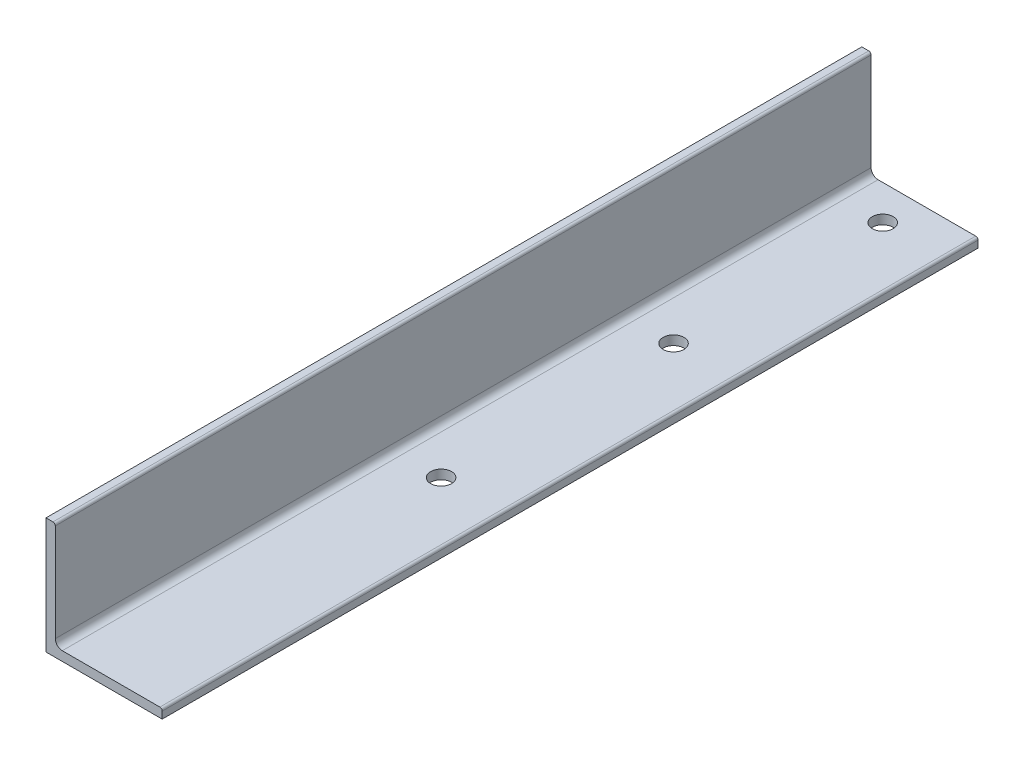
from build123d import *

# Parameters (mm, degrees)
BOSS_EXTRUDE1_DEPTH = 702
SKETCH2_R           = 9
CUT_EXTRUDE1_DEPTH  = 8
LPATTERN1_COUNT     = 2
LPATTERN1_PITCH     = 180
LPATTERN2_COUNT     = 2
LPATTERN2_PITCH     = 380


with BuildPart() as part:
    # Sketch1 → Boss-Extrude1 (new body)
    with BuildSketch(Plane.XY):
        with BuildLine():
            Line((0, 100), (0, 0))
            Line((0, 0), (100, 0))
            Line((100, 0), (100, 6))
            ThreePointArc((100, 6), (99.414213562, 7.414213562), (98, 8))
            Line((98, 8), (14, 8))
            ThreePointArc((14, 8), (9.757359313, 9.757359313), (8, 14))
            Line((8, 14), (8, 98))
            ThreePointArc((8, 98), (7.414213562, 99.414213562), (6, 100))
            Line((6, 100), (0, 100))
        make_face()
    extrude(amount=BOSS_EXTRUDE1_DEPTH)

    # Sketch2 → Cut-Extrude1 (cut)
    with BuildSketch(Plane(origin=(0, 8, 0), x_dir=(1, 0, 0), z_dir=(0, 1, 0))):
        with Locations(Location((48, -30, 0), (0, 0, 180))):
            Circle(SKETCH2_R)
    cut_extrude1 = extrude(amount=-CUT_EXTRUDE1_DEPTH, mode=Mode.SUBTRACT)

    # LPattern1: Cut-Extrude1 ×2
    with Locations(*[(0, 0, i * LPATTERN1_PITCH) for i in range(1, LPATTERN1_COUNT)]):
        add(cut_extrude1, mode=Mode.SUBTRACT)

    # LPattern2: Cut-Extrude1 ×2
    with Locations(*[(0, 0, i * LPATTERN2_PITCH) for i in range(1, LPATTERN2_COUNT)]):
        add(cut_extrude1, mode=Mode.SUBTRACT)


solid = part.part
